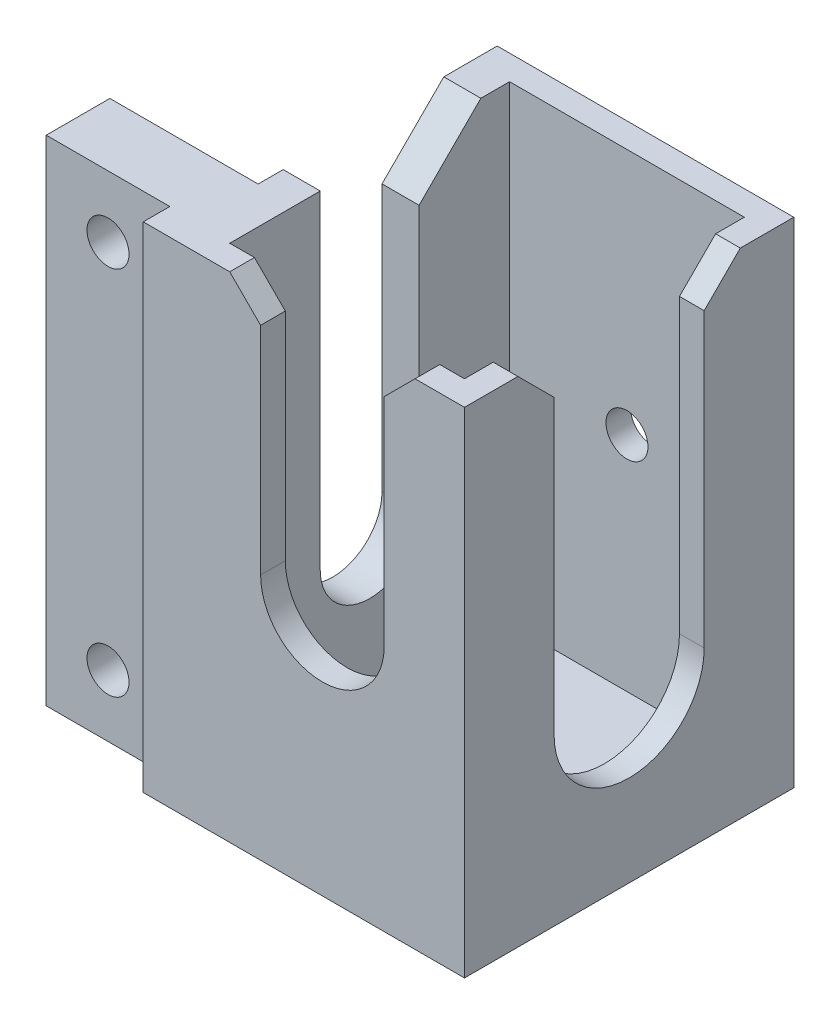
ISO-10303-21;
HEADER;
FILE_DESCRIPTION(('STEP AP214'),'2;1');
FILE_NAME('part.step','',(''),(''),'','','');
FILE_SCHEMA(('AUTOMOTIVE_DESIGN { 1 0 10303 214 1 1 1 1 }'));
ENDSEC;
DATA;
#1=APPLICATION_CONTEXT('core data for automotive mechanical design processes');
#2=APPLICATION_PROTOCOL_DEFINITION('international standard','automotive_design',2000,#1);
#3=PRODUCT_CONTEXT('',#1,'mechanical');
#4=PRODUCT('Part','Part','',(#3));
#5=PRODUCT_RELATED_PRODUCT_CATEGORY('part','',(#4));
#6=PRODUCT_DEFINITION_FORMATION('','',#4);
#7=PRODUCT_DEFINITION_CONTEXT('part definition',#1,'design');
#8=PRODUCT_DEFINITION('design','',#6,#7);
#9=PRODUCT_DEFINITION_SHAPE('','',#8);
#10=(LENGTH_UNIT() NAMED_UNIT(*) SI_UNIT(.MILLI.,.METRE.));
#11=(NAMED_UNIT(*) PLANE_ANGLE_UNIT() SI_UNIT($,.RADIAN.));
#12=(NAMED_UNIT(*) SI_UNIT($,.STERADIAN.) SOLID_ANGLE_UNIT());
#13=UNCERTAINTY_MEASURE_WITH_UNIT(LENGTH_MEASURE(1.E-05),#10,'distance_accuracy_value','');
#14=(GEOMETRIC_REPRESENTATION_CONTEXT(3) GLOBAL_UNCERTAINTY_ASSIGNED_CONTEXT((#13)) GLOBAL_UNIT_ASSIGNED_CONTEXT((#10,
#11,#12)) REPRESENTATION_CONTEXT('',''));
#15=CARTESIAN_POINT('',(0.,0.,0.));
#16=DIRECTION('',(0.,0.,1.));
#17=DIRECTION('',(1.,0.,0.));
#18=AXIS2_PLACEMENT_3D('',#15,#16,#17);
#19=CARTESIAN_POINT('',(-12.5000000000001,40.,6.02500000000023));
#20=DIRECTION('',(0.,0.,1.));
#21=DIRECTION('',(1.,0.,0.));
#22=AXIS2_PLACEMENT_3D('',#19,#20,#21);
#23=PLANE('',#22);
#24=CARTESIAN_POINT('',(-19.5000000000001,5.,6.02500000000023));
#25=DIRECTION('',(0.,0.,-1.));
#26=DIRECTION('',(-1.,0.,0.));
#27=AXIS2_PLACEMENT_3D('',#24,#25,#26);
#28=CIRCLE('',#27,3.5);
#29=CARTESIAN_POINT('',(-23.0000000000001,5.,6.02500000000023));
#30=VERTEX_POINT('',#29);
#31=EDGE_CURVE('E420',#30,#30,#28,.T.);
#32=ORIENTED_EDGE('',*,*,#31,.F.);
#33=EDGE_LOOP('',(#32));
#34=FACE_BOUND('',#33,.T.);
#35=DIRECTION('',(0.,-1.,0.));
#36=VECTOR('',#35,1.);
#37=CARTESIAN_POINT('',(-24.5000000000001,40.,6.02500000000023));
#38=LINE('',#37,#36);
#39=CARTESIAN_POINT('',(-24.5000000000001,10.,6.02500000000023));
#40=VERTEX_POINT('',#39);
#41=CARTESIAN_POINT('',(-24.5000000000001,0.,6.02500000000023));
#42=VERTEX_POINT('',#41);
#43=EDGE_CURVE('E384',#40,#42,#38,.T.);
#44=ORIENTED_EDGE('',*,*,#43,.F.);
#45=DIRECTION('',(-1.,0.,0.));
#46=VECTOR('',#45,1.);
#47=CARTESIAN_POINT('',(7.92602506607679,10.,6.02500000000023));
#48=LINE('',#47,#46);
#49=CARTESIAN_POINT('',(-12.5000000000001,10.,6.02500000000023));
#50=VERTEX_POINT('',#49);
#51=EDGE_CURVE('E470',#50,#40,#48,.T.);
#52=ORIENTED_EDGE('',*,*,#51,.F.);
#53=DIRECTION('',(0.,-1.,0.));
#54=VECTOR('',#53,1.);
#55=CARTESIAN_POINT('',(-12.5000000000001,40.,6.02500000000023));
#56=LINE('',#55,#54);
#57=CARTESIAN_POINT('',(-12.5000000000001,0.,6.02500000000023));
#58=VERTEX_POINT('',#57);
#59=EDGE_CURVE('E388',#50,#58,#56,.T.);
#60=ORIENTED_EDGE('',*,*,#59,.T.);
#61=DIRECTION('',(-1.,0.,0.));
#62=VECTOR('',#61,1.);
#63=CARTESIAN_POINT('',(-12.5000000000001,0.,6.02500000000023));
#64=LINE('',#63,#62);
#65=EDGE_CURVE('E373',#58,#42,#64,.T.);
#66=ORIENTED_EDGE('',*,*,#65,.T.);
#67=EDGE_LOOP('',(#44,#52,#60,#66));
#68=FACE_BOUND('',#67,.T.);
#69=ADVANCED_FACE('F41',(#34,#68),#23,.F.);
#70=CARTESIAN_POINT('',(0.,40.,0.));
#71=DIRECTION('',(0.,1.,0.));
#72=DIRECTION('',(0.,0.,1.));
#73=AXIS2_PLACEMENT_3D('',#70,#71,#72);
#74=PLANE('',#73);
#75=DIRECTION('',(1.,0.,0.));
#76=VECTOR('',#75,1.);
#77=CARTESIAN_POINT('',(-9.50000000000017,40.,11.3250000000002));
#78=LINE('',#77,#76);
#79=CARTESIAN_POINT('',(7.5,40.,11.3250000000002));
#80=VERTEX_POINT('',#79);
#81=CARTESIAN_POINT('',(9.50000000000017,40.,11.3250000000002));
#82=VERTEX_POINT('',#81);
#83=EDGE_CURVE('E318',#80,#82,#78,.T.);
#84=ORIENTED_EDGE('',*,*,#83,.F.);
#85=DIRECTION('',(0.,0.,1.));
#86=VECTOR('',#85,1.);
#87=CARTESIAN_POINT('',(7.5,40.,13.3250000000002));
#88=LINE('',#87,#86);
#89=CARTESIAN_POINT('',(7.5,40.,13.3250000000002));
#90=VERTEX_POINT('',#89);
#91=EDGE_CURVE('E11',#80,#90,#88,.T.);
#92=ORIENTED_EDGE('',*,*,#91,.T.);
#93=DIRECTION('',(1.,0.,0.));
#94=VECTOR('',#93,1.);
#95=CARTESIAN_POINT('',(-14.5000000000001,40.,13.3250000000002));
#96=LINE('',#95,#94);
#97=CARTESIAN_POINT('',(11.5000000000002,40.,13.3250000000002));
#98=VERTEX_POINT('',#97);
#99=EDGE_CURVE('E337',#90,#98,#96,.T.);
#100=ORIENTED_EDGE('',*,*,#99,.T.);
#101=DIRECTION('',(0.,0.,-1.));
#102=VECTOR('',#101,1.);
#103=CARTESIAN_POINT('',(11.5000000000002,40.,13.3250000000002));
#104=LINE('',#103,#102);
#105=CARTESIAN_POINT('',(11.5000000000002,40.,9.00000000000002));
#106=VERTEX_POINT('',#105);
#107=EDGE_CURVE('E343',#98,#106,#104,.T.);
#108=ORIENTED_EDGE('',*,*,#107,.T.);
#109=DIRECTION('',(1.,0.,0.));
#110=VECTOR('',#109,1.);
#111=CARTESIAN_POINT('',(2.42893218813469,40.,9.00000000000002));
#112=LINE('',#111,#110);
#113=CARTESIAN_POINT('',(9.50000000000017,40.,9.00000000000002));
#114=VERTEX_POINT('',#113);
#115=EDGE_CURVE('E562',#114,#106,#112,.T.);
#116=ORIENTED_EDGE('',*,*,#115,.F.);
#117=DIRECTION('',(0.,0.,-1.));
#118=VECTOR('',#117,1.);
#119=CARTESIAN_POINT('',(9.50000000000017,40.,11.3250000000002));
#120=LINE('',#119,#118);
#121=EDGE_CURVE('E304',#82,#114,#120,.T.);
#122=ORIENTED_EDGE('',*,*,#121,.F.);
#123=EDGE_LOOP('',(#84,#92,#100,#108,#116,#122));
#124=FACE_BOUND('',#123,.T.);
#125=ADVANCED_FACE('F554',(#124),#74,.T.);
#126=CARTESIAN_POINT('',(-14.5000000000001,40.,13.3250000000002));
#127=VERTEX_POINT('',#126);
#128=CARTESIAN_POINT('',(-7.5,40.,13.3250000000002));
#129=VERTEX_POINT('',#128);
#130=EDGE_CURVE('E339',#127,#129,#96,.T.);
#131=ORIENTED_EDGE('',*,*,#130,.T.);
#132=DIRECTION('',(0.,0.,-1.));
#133=VECTOR('',#132,1.);
#134=CARTESIAN_POINT('',(-7.5,40.,11.3250000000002));
#135=LINE('',#134,#133);
#136=CARTESIAN_POINT('',(-7.5,40.,11.3250000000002));
#137=VERTEX_POINT('',#136);
#138=EDGE_CURVE('E442',#129,#137,#135,.T.);
#139=ORIENTED_EDGE('',*,*,#138,.T.);
#140=CARTESIAN_POINT('',(-9.50000000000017,40.,11.3250000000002));
#141=VERTEX_POINT('',#140);
#142=EDGE_CURVE('E319',#141,#137,#78,.T.);
#143=ORIENTED_EDGE('',*,*,#142,.F.);
#144=DIRECTION('',(0.,0.,1.));
#145=VECTOR('',#144,1.);
#146=CARTESIAN_POINT('',(-9.50000000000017,40.,-11.3250000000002));
#147=LINE('',#146,#145);
#148=CARTESIAN_POINT('',(-9.50000000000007,40.,4.));
#149=VERTEX_POINT('',#148);
#150=EDGE_CURVE('E314',#149,#141,#147,.T.);
#151=ORIENTED_EDGE('',*,*,#150,.F.);
#152=DIRECTION('',(1.,0.,0.));
#153=VECTOR('',#152,1.);
#154=CARTESIAN_POINT('',(0.,40.,4.));
#155=LINE('',#154,#153);
#156=CARTESIAN_POINT('',(-12.5000000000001,40.,4.));
#157=VERTEX_POINT('',#156);
#158=EDGE_CURVE('E507',#157,#149,#155,.T.);
#159=ORIENTED_EDGE('',*,*,#158,.F.);
#160=DIRECTION('',(0.,0.,1.));
#161=VECTOR('',#160,1.);
#162=CARTESIAN_POINT('',(-12.5000000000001,40.,-13.3250000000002));
#163=LINE('',#162,#161);
#164=CARTESIAN_POINT('',(-12.5000000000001,40.,6.02500000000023));
#165=VERTEX_POINT('',#164);
#166=EDGE_CURVE('E348',#157,#165,#163,.T.);
#167=ORIENTED_EDGE('',*,*,#166,.T.);
#168=DIRECTION('',(-1.,0.,0.));
#169=VECTOR('',#168,1.);
#170=CARTESIAN_POINT('',(-12.5000000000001,40.,6.02500000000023));
#171=LINE('',#170,#169);
#172=CARTESIAN_POINT('',(-24.5000000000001,40.,6.02500000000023));
#173=VERTEX_POINT('',#172);
#174=EDGE_CURVE('E352',#165,#173,#171,.T.);
#175=ORIENTED_EDGE('',*,*,#174,.T.);
#176=DIRECTION('',(0.,0.,1.));
#177=VECTOR('',#176,1.);
#178=CARTESIAN_POINT('',(-24.5000000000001,40.,6.02500000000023));
#179=LINE('',#178,#177);
#180=CARTESIAN_POINT('',(-24.5000000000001,40.,11.1750000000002));
#181=VERTEX_POINT('',#180);
#182=EDGE_CURVE('E354',#173,#181,#179,.T.);
#183=ORIENTED_EDGE('',*,*,#182,.T.);
#184=DIRECTION('',(1.,0.,0.));
#185=VECTOR('',#184,1.);
#186=CARTESIAN_POINT('',(-24.5000000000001,40.,11.1750000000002));
#187=LINE('',#186,#185);
#188=CARTESIAN_POINT('',(-14.5000000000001,40.,11.1750000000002));
#189=VERTEX_POINT('',#188);
#190=EDGE_CURVE('E356',#181,#189,#187,.T.);
#191=ORIENTED_EDGE('',*,*,#190,.T.);
#192=DIRECTION('',(0.,0.,1.));
#193=VECTOR('',#192,1.);
#194=CARTESIAN_POINT('',(-14.5000000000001,40.,11.1750000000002));
#195=LINE('',#194,#193);
#196=EDGE_CURVE('E334',#189,#127,#195,.T.);
#197=ORIENTED_EDGE('',*,*,#196,.T.);
#198=EDGE_LOOP('',(#131,#139,#143,#151,#159,#167,#175,#183,#191,#197));
#199=FACE_BOUND('',#198,.T.);
#200=ADVANCED_FACE('F630',(#199),#74,.T.);
#201=CARTESIAN_POINT('',(9.50000000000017,40.,11.3250000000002));
#202=DIRECTION('',(-1.,0.,0.));
#203=DIRECTION('',(0.,0.,1.));
#204=AXIS2_PLACEMENT_3D('',#201,#202,#203);
#205=PLANE('',#204);
#206=DIRECTION('',(0.,0.707106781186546,-0.707106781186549));
#207=VECTOR('',#206,1.);
#208=CARTESIAN_POINT('',(9.50000000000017,35.,-4.));
#209=LINE('',#208,#207);
#210=CARTESIAN_POINT('',(9.50000000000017,37.075,-6.075));
#211=VERTEX_POINT('',#210);
#212=CARTESIAN_POINT('',(9.50000000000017,40.,-9.00000000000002));
#213=VERTEX_POINT('',#212);
#214=EDGE_CURVE('E282',#211,#213,#209,.T.);
#215=ORIENTED_EDGE('',*,*,#214,.T.);
#216=CARTESIAN_POINT('',(9.50000000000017,40.,-11.3250000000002));
#217=VERTEX_POINT('',#216);
#218=EDGE_CURVE('E295',#213,#217,#120,.T.);
#219=ORIENTED_EDGE('',*,*,#218,.T.);
#220=DIRECTION('',(0.,-1.,0.));
#221=VECTOR('',#220,1.);
#222=CARTESIAN_POINT('',(9.50000000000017,40.,-11.3250000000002));
#223=LINE('',#222,#221);
#224=CARTESIAN_POINT('',(9.50000000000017,2.,-11.3250000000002));
#225=VERTEX_POINT('',#224);
#226=EDGE_CURVE('E331',#217,#225,#223,.T.);
#227=ORIENTED_EDGE('',*,*,#226,.T.);
#228=DIRECTION('',(0.,0.,1.));
#229=VECTOR('',#228,1.);
#230=CARTESIAN_POINT('',(9.50000000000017,2.,11.3250000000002));
#231=LINE('',#230,#229);
#232=CARTESIAN_POINT('',(9.50000000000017,2.,11.3250000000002));
#233=VERTEX_POINT('',#232);
#234=EDGE_CURVE('E305',#225,#233,#231,.T.);
#235=ORIENTED_EDGE('',*,*,#234,.T.);
#236=DIRECTION('',(0.,-1.,0.));
#237=VECTOR('',#236,1.);
#238=CARTESIAN_POINT('',(9.50000000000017,40.,11.3250000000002));
#239=LINE('',#238,#237);
#240=EDGE_CURVE('E322',#82,#233,#239,.T.);
#241=ORIENTED_EDGE('',*,*,#240,.F.);
#242=ORIENTED_EDGE('',*,*,#121,.T.);
#243=DIRECTION('',(0.,-0.707106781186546,-0.707106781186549));
#244=VECTOR('',#243,1.);
#245=CARTESIAN_POINT('',(9.50000000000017,35.,4.));
#246=LINE('',#245,#244);
#247=CARTESIAN_POINT('',(9.50000000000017,37.075,6.075));
#248=VERTEX_POINT('',#247);
#249=EDGE_CURVE('E569',#114,#248,#246,.T.);
#250=ORIENTED_EDGE('',*,*,#249,.T.);
#251=DIRECTION('',(0.,1.,0.));
#252=VECTOR('',#251,1.);
#253=CARTESIAN_POINT('',(9.50000000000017,43.3626682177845,6.075));
#254=LINE('',#253,#252);
#255=CARTESIAN_POINT('',(9.50000000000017,13.43,6.075));
#256=VERTEX_POINT('',#255);
#257=EDGE_CURVE('E477',#256,#248,#254,.T.);
#258=ORIENTED_EDGE('',*,*,#257,.F.);
#259=CARTESIAN_POINT('',(9.50000000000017,13.43,0.));
#260=DIRECTION('',(-1.,0.,0.));
#261=DIRECTION('',(0.,0.,1.));
#262=AXIS2_PLACEMENT_3D('',#259,#260,#261);
#263=CIRCLE('',#262,6.075);
#264=CARTESIAN_POINT('',(9.50000000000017,13.43,-6.075));
#265=VERTEX_POINT('',#264);
#266=EDGE_CURVE('E482',#265,#256,#263,.T.);
#267=ORIENTED_EDGE('',*,*,#266,.F.);
#268=DIRECTION('',(0.,-1.,0.));
#269=VECTOR('',#268,1.);
#270=CARTESIAN_POINT('',(9.50000000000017,43.3626682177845,-6.075));
#271=LINE('',#270,#269);
#272=EDGE_CURVE('E298',#211,#265,#271,.T.);
#273=ORIENTED_EDGE('',*,*,#272,.F.);
#274=EDGE_LOOP('',(#215,#219,#227,#235,#241,#242,#250,#258,#267,#273));
#275=FACE_BOUND('',#274,.T.);
#276=ADVANCED_FACE('F293',(#275),#205,.T.);
#277=CARTESIAN_POINT('',(9.50000000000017,40.,-11.3250000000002));
#278=DIRECTION('',(0.,0.,1.));
#279=DIRECTION('',(1.,0.,0.));
#280=AXIS2_PLACEMENT_3D('',#277,#278,#279);
#281=PLANE('',#280);
#282=CARTESIAN_POINT('',(0.,20.,-11.3250000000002));
#283=DIRECTION('',(0.,0.,1.));
#284=DIRECTION('',(1.,0.,0.));
#285=AXIS2_PLACEMENT_3D('',#282,#283,#284);
#286=CIRCLE('',#285,1.7);
#287=CARTESIAN_POINT('',(1.7,20.,-11.3250000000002));
#288=VERTEX_POINT('',#287);
#289=EDGE_CURVE('E578',#288,#288,#286,.F.);
#290=ORIENTED_EDGE('',*,*,#289,.T.);
#291=EDGE_LOOP('',(#290));
#292=FACE_BOUND('',#291,.T.);
#293=DIRECTION('',(0.,-1.,0.));
#294=VECTOR('',#293,1.);
#295=CARTESIAN_POINT('',(-9.50000000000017,40.,-11.3250000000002));
#296=LINE('',#295,#294);
#297=CARTESIAN_POINT('',(-9.50000000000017,40.,-11.3250000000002));
#298=VERTEX_POINT('',#297);
#299=CARTESIAN_POINT('',(-9.50000000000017,2.,-11.3250000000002));
#300=VERTEX_POINT('',#299);
#301=EDGE_CURVE('E328',#298,#300,#296,.T.);
#302=ORIENTED_EDGE('',*,*,#301,.T.);
#303=DIRECTION('',(1.,0.,0.));
#304=VECTOR('',#303,1.);
#305=CARTESIAN_POINT('',(9.50000000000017,2.,-11.3250000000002));
#306=LINE('',#305,#304);
#307=EDGE_CURVE('E309',#300,#225,#306,.T.);
#308=ORIENTED_EDGE('',*,*,#307,.T.);
#309=ORIENTED_EDGE('',*,*,#226,.F.);
#310=DIRECTION('',(-1.,0.,0.));
#311=VECTOR('',#310,1.);
#312=CARTESIAN_POINT('',(9.50000000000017,40.,-11.3250000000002));
#313=LINE('',#312,#311);
#314=EDGE_CURVE('E303',#217,#298,#313,.T.);
#315=ORIENTED_EDGE('',*,*,#314,.T.);
#316=EDGE_LOOP('',(#302,#308,#309,#315));
#317=FACE_BOUND('',#316,.T.);
#318=ADVANCED_FACE('F547',(#292,#317),#281,.T.);
#319=CARTESIAN_POINT('',(-9.50000000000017,40.,-11.3250000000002));
#320=DIRECTION('',(1.,0.,0.));
#321=DIRECTION('',(0.,0.,-1.));
#322=AXIS2_PLACEMENT_3D('',#319,#320,#321);
#323=PLANE('',#322);
#324=CARTESIAN_POINT('',(-9.50000000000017,40.,-9.00000000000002));
#325=VERTEX_POINT('',#324);
#326=EDGE_CURVE('E315',#298,#325,#147,.T.);
#327=ORIENTED_EDGE('',*,*,#326,.T.);
#328=DIRECTION('',(0.,-0.707106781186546,0.707106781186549));
#329=VECTOR('',#328,1.);
#330=CARTESIAN_POINT('',(-9.50000000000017,41.1625000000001,-10.1625000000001));
#331=LINE('',#330,#329);
#332=CARTESIAN_POINT('',(-9.50000000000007,35.,-4.));
#333=VERTEX_POINT('',#332);
#334=EDGE_CURVE('E428',#325,#333,#331,.T.);
#335=ORIENTED_EDGE('',*,*,#334,.T.);
#336=DIRECTION('',(0.,-1.,0.));
#337=VECTOR('',#336,1.);
#338=CARTESIAN_POINT('',(-9.50000000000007,46.4459505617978,-4.));
#339=LINE('',#338,#337);
#340=CARTESIAN_POINT('',(-9.50000000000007,13.43,-3.99999999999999));
#341=VERTEX_POINT('',#340);
#342=EDGE_CURVE('E492',#333,#341,#339,.T.);
#343=ORIENTED_EDGE('',*,*,#342,.T.);
#344=CARTESIAN_POINT('',(-9.50000000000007,13.43,0.));
#345=DIRECTION('',(-1.,0.,0.));
#346=DIRECTION('',(0.,0.,1.));
#347=AXIS2_PLACEMENT_3D('',#344,#345,#346);
#348=CIRCLE('',#347,4.);
#349=CARTESIAN_POINT('',(-9.50000000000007,13.43,4.));
#350=VERTEX_POINT('',#349);
#351=EDGE_CURVE('E494',#341,#350,#348,.T.);
#352=ORIENTED_EDGE('',*,*,#351,.T.);
#353=DIRECTION('',(0.,1.,0.));
#354=VECTOR('',#353,1.);
#355=CARTESIAN_POINT('',(-9.50000000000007,46.4459505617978,4.));
#356=LINE('',#355,#354);
#357=EDGE_CURVE('E498',#350,#149,#356,.T.);
#358=ORIENTED_EDGE('',*,*,#357,.T.);
#359=ORIENTED_EDGE('',*,*,#150,.T.);
#360=DIRECTION('',(0.,-1.,0.));
#361=VECTOR('',#360,1.);
#362=CARTESIAN_POINT('',(-9.50000000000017,40.,11.3250000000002));
#363=LINE('',#362,#361);
#364=CARTESIAN_POINT('',(-9.50000000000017,2.,11.3250000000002));
#365=VERTEX_POINT('',#364);
#366=EDGE_CURVE('E325',#141,#365,#363,.T.);
#367=ORIENTED_EDGE('',*,*,#366,.T.);
#368=DIRECTION('',(0.,0.,-1.));
#369=VECTOR('',#368,1.);
#370=CARTESIAN_POINT('',(-9.50000000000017,2.,-11.3250000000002));
#371=LINE('',#370,#369);
#372=EDGE_CURVE('E537',#365,#300,#371,.T.);
#373=ORIENTED_EDGE('',*,*,#372,.T.);
#374=ORIENTED_EDGE('',*,*,#301,.F.);
#375=EDGE_LOOP('',(#327,#335,#343,#352,#358,#359,#367,#373,#374));
#376=FACE_BOUND('',#375,.T.);
#377=ADVANCED_FACE('F698',(#376),#323,.T.);
#378=CARTESIAN_POINT('',(-9.50000000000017,40.,11.3250000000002));
#379=DIRECTION('',(0.,0.,-1.));
#380=DIRECTION('',(-1.,0.,0.));
#381=AXIS2_PLACEMENT_3D('',#378,#379,#380);
#382=PLANE('',#381);
#383=ORIENTED_EDGE('',*,*,#142,.T.);
#384=DIRECTION('',(0.707106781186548,-0.707106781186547,0.));
#385=VECTOR('',#384,1.);
#386=CARTESIAN_POINT('',(-8.50000000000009,41.0000000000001,11.3250000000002));
#387=LINE('',#386,#385);
#388=CARTESIAN_POINT('',(-5.,37.5,11.3250000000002));
#389=VERTEX_POINT('',#388);
#390=EDGE_CURVE('E445',#137,#389,#387,.T.);
#391=ORIENTED_EDGE('',*,*,#390,.T.);
#392=DIRECTION('',(0.,-1.,0.));
#393=VECTOR('',#392,1.);
#394=CARTESIAN_POINT('',(-5.,47.9306355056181,11.3250000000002));
#395=LINE('',#394,#393);
#396=CARTESIAN_POINT('',(-5.,20.,11.3250000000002));
#397=VERTEX_POINT('',#396);
#398=EDGE_CURVE('E463',#389,#397,#395,.T.);
#399=ORIENTED_EDGE('',*,*,#398,.T.);
#400=CARTESIAN_POINT('',(0.,20.,11.3250000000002));
#401=DIRECTION('',(0.,0.,1.));
#402=DIRECTION('',(1.,0.,0.));
#403=AXIS2_PLACEMENT_3D('',#400,#401,#402);
#404=CIRCLE('',#403,5.);
#405=CARTESIAN_POINT('',(5.,20.,11.3250000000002));
#406=VERTEX_POINT('',#405);
#407=EDGE_CURVE('E457',#397,#406,#404,.T.);
#408=ORIENTED_EDGE('',*,*,#407,.T.);
#409=DIRECTION('',(0.,1.,0.));
#410=VECTOR('',#409,1.);
#411=CARTESIAN_POINT('',(5.,47.9306355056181,11.3250000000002));
#412=LINE('',#411,#410);
#413=CARTESIAN_POINT('',(5.,37.5,11.3250000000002));
#414=VERTEX_POINT('',#413);
#415=EDGE_CURVE('E450',#406,#414,#412,.T.);
#416=ORIENTED_EDGE('',*,*,#415,.T.);
#417=DIRECTION('',(0.707106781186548,0.707106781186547,0.));
#418=VECTOR('',#417,1.);
#419=CARTESIAN_POINT('',(-1.00000000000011,31.4999999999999,11.3250000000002));
#420=LINE('',#419,#418);
#421=EDGE_CURVE('E57',#414,#80,#420,.T.);
#422=ORIENTED_EDGE('',*,*,#421,.T.);
#423=ORIENTED_EDGE('',*,*,#83,.T.);
#424=ORIENTED_EDGE('',*,*,#240,.T.);
#425=DIRECTION('',(-1.,0.,0.));
#426=VECTOR('',#425,1.);
#427=CARTESIAN_POINT('',(-9.50000000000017,2.,11.3250000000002));
#428=LINE('',#427,#426);
#429=EDGE_CURVE('E400',#233,#365,#428,.T.);
#430=ORIENTED_EDGE('',*,*,#429,.T.);
#431=ORIENTED_EDGE('',*,*,#366,.F.);
#432=EDGE_LOOP('',(#383,#391,#399,#408,#416,#422,#423,#424,#430,#431));
#433=FACE_BOUND('',#432,.T.);
#434=ADVANCED_FACE('F455',(#433),#382,.T.);
#435=DIRECTION('',(1.,0.,0.));
#436=VECTOR('',#435,1.);
#437=CARTESIAN_POINT('',(2.42893218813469,40.,-9.00000000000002));
#438=LINE('',#437,#436);
#439=CARTESIAN_POINT('',(11.5000000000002,40.,-9.00000000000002));
#440=VERTEX_POINT('',#439);
#441=EDGE_CURVE('E279',#213,#440,#438,.T.);
#442=ORIENTED_EDGE('',*,*,#441,.T.);
#443=CARTESIAN_POINT('',(11.5000000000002,40.,-13.3250000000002));
#444=VERTEX_POINT('',#443);
#445=EDGE_CURVE('E342',#440,#444,#104,.T.);
#446=ORIENTED_EDGE('',*,*,#445,.T.);
#447=DIRECTION('',(-1.,0.,0.));
#448=VECTOR('',#447,1.);
#449=CARTESIAN_POINT('',(11.5000000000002,40.,-13.3250000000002));
#450=LINE('',#449,#448);
#451=CARTESIAN_POINT('',(-12.5000000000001,40.,-13.3250000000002));
#452=VERTEX_POINT('',#451);
#453=EDGE_CURVE('E346',#444,#452,#450,.T.);
#454=ORIENTED_EDGE('',*,*,#453,.T.);
#455=CARTESIAN_POINT('',(-12.5000000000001,40.,-9.00000000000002));
#456=VERTEX_POINT('',#455);
#457=EDGE_CURVE('E349',#452,#456,#163,.T.);
#458=ORIENTED_EDGE('',*,*,#457,.T.);
#459=DIRECTION('',(1.,0.,0.));
#460=VECTOR('',#459,1.);
#461=CARTESIAN_POINT('',(-9.50000000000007,40.,-9.00000000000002));
#462=LINE('',#461,#460);
#463=EDGE_CURVE('E426',#456,#325,#462,.T.);
#464=ORIENTED_EDGE('',*,*,#463,.T.);
#465=ORIENTED_EDGE('',*,*,#326,.F.);
#466=ORIENTED_EDGE('',*,*,#314,.F.);
#467=ORIENTED_EDGE('',*,*,#218,.F.);
#468=EDGE_LOOP('',(#442,#446,#454,#458,#464,#465,#466,#467));
#469=FACE_BOUND('',#468,.T.);
#470=ADVANCED_FACE('F301',(#469),#74,.T.);
#471=CARTESIAN_POINT('',(0.,0.,0.));
#472=DIRECTION('',(0.,1.,0.));
#473=DIRECTION('',(0.,0.,1.));
#474=AXIS2_PLACEMENT_3D('',#471,#472,#473);
#475=PLANE('',#474);
#476=DIRECTION('',(0.,0.,1.));
#477=VECTOR('',#476,1.);
#478=CARTESIAN_POINT('',(-14.5000000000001,0.,11.1750000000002));
#479=LINE('',#478,#477);
#480=CARTESIAN_POINT('',(-14.5000000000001,0.,11.1750000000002));
#481=VERTEX_POINT('',#480);
#482=CARTESIAN_POINT('',(-14.5000000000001,0.,13.3250000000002));
#483=VERTEX_POINT('',#482);
#484=EDGE_CURVE('E333',#481,#483,#479,.T.);
#485=ORIENTED_EDGE('',*,*,#484,.F.);
#486=DIRECTION('',(1.,0.,0.));
#487=VECTOR('',#486,1.);
#488=CARTESIAN_POINT('',(-24.5000000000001,0.,11.1750000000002));
#489=LINE('',#488,#487);
#490=CARTESIAN_POINT('',(-24.5000000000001,0.,11.1750000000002));
#491=VERTEX_POINT('',#490);
#492=EDGE_CURVE('E338',#491,#481,#489,.T.);
#493=ORIENTED_EDGE('',*,*,#492,.F.);
#494=DIRECTION('',(0.,0.,1.));
#495=VECTOR('',#494,1.);
#496=CARTESIAN_POINT('',(-24.5000000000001,0.,6.02500000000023));
#497=LINE('',#496,#495);
#498=EDGE_CURVE('E376',#42,#491,#497,.T.);
#499=ORIENTED_EDGE('',*,*,#498,.F.);
#500=ORIENTED_EDGE('',*,*,#65,.F.);
#501=DIRECTION('',(0.,0.,1.));
#502=VECTOR('',#501,1.);
#503=CARTESIAN_POINT('',(-12.5000000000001,0.,-13.3250000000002));
#504=LINE('',#503,#502);
#505=CARTESIAN_POINT('',(-12.5000000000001,0.,-13.3250000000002));
#506=VERTEX_POINT('',#505);
#507=EDGE_CURVE('E370',#506,#58,#504,.T.);
#508=ORIENTED_EDGE('',*,*,#507,.F.);
#509=DIRECTION('',(-1.,0.,0.));
#510=VECTOR('',#509,1.);
#511=CARTESIAN_POINT('',(11.5000000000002,0.,-13.3250000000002));
#512=LINE('',#511,#510);
#513=CARTESIAN_POINT('',(11.5000000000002,0.,-13.3250000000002));
#514=VERTEX_POINT('',#513);
#515=EDGE_CURVE('E367',#514,#506,#512,.T.);
#516=ORIENTED_EDGE('',*,*,#515,.F.);
#517=DIRECTION('',(0.,0.,-1.));
#518=VECTOR('',#517,1.);
#519=CARTESIAN_POINT('',(11.5000000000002,0.,13.3250000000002));
#520=LINE('',#519,#518);
#521=CARTESIAN_POINT('',(11.5000000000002,0.,13.3250000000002));
#522=VERTEX_POINT('',#521);
#523=EDGE_CURVE('E364',#522,#514,#520,.T.);
#524=ORIENTED_EDGE('',*,*,#523,.F.);
#525=DIRECTION('',(1.,0.,0.));
#526=VECTOR('',#525,1.);
#527=CARTESIAN_POINT('',(-14.5000000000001,0.,13.3250000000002));
#528=LINE('',#527,#526);
#529=EDGE_CURVE('E361',#483,#522,#528,.T.);
#530=ORIENTED_EDGE('',*,*,#529,.F.);
#531=EDGE_LOOP('',(#485,#493,#499,#500,#508,#516,#524,#530));
#532=FACE_BOUND('',#531,.T.);
#533=DIRECTION('',(-1.,0.,0.));
#534=VECTOR('',#533,1.);
#535=CARTESIAN_POINT('',(1.7299999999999,0.,2.74999999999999));
#536=LINE('',#535,#534);
#537=CARTESIAN_POINT('',(1.7299999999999,0.,2.74999999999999));
#538=VERTEX_POINT('',#537);
#539=CARTESIAN_POINT('',(-1.7299999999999,0.,2.75000000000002));
#540=VERTEX_POINT('',#539);
#541=EDGE_CURVE('E511',#538,#540,#536,.T.);
#542=ORIENTED_EDGE('',*,*,#541,.F.);
#543=DIRECTION('',(0.,0.,1.));
#544=VECTOR('',#543,1.);
#545=CARTESIAN_POINT('',(1.7299999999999,0.,-2.75000000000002));
#546=LINE('',#545,#544);
#547=CARTESIAN_POINT('',(1.7299999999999,0.,-2.75000000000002));
#548=VERTEX_POINT('',#547);
#549=EDGE_CURVE('E516',#548,#538,#546,.T.);
#550=ORIENTED_EDGE('',*,*,#549,.F.);
#551=DIRECTION('',(1.,0.,0.));
#552=VECTOR('',#551,1.);
#553=CARTESIAN_POINT('',(-1.7299999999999,0.,-2.74999999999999));
#554=LINE('',#553,#552);
#555=CARTESIAN_POINT('',(-1.7299999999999,0.,-2.74999999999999));
#556=VERTEX_POINT('',#555);
#557=EDGE_CURVE('E530',#556,#548,#554,.T.);
#558=ORIENTED_EDGE('',*,*,#557,.F.);
#559=DIRECTION('',(0.,0.,-1.));
#560=VECTOR('',#559,1.);
#561=CARTESIAN_POINT('',(-1.7299999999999,0.,2.75000000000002));
#562=LINE('',#561,#560);
#563=EDGE_CURVE('E527',#540,#556,#562,.T.);
#564=ORIENTED_EDGE('',*,*,#563,.F.);
#565=EDGE_LOOP('',(#542,#550,#558,#564));
#566=FACE_BOUND('',#565,.T.);
#567=ADVANCED_FACE('F734',(#532,#566),#475,.F.);
#568=CARTESIAN_POINT('',(-14.5000000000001,40.,11.1750000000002));
#569=DIRECTION('',(1.,0.,0.));
#570=DIRECTION('',(0.,0.,-1.));
#571=AXIS2_PLACEMENT_3D('',#568,#569,#570);
#572=PLANE('',#571);
#573=ORIENTED_EDGE('',*,*,#484,.T.);
#574=DIRECTION('',(0.,-1.,0.));
#575=VECTOR('',#574,1.);
#576=CARTESIAN_POINT('',(-14.5000000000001,40.,13.3250000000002));
#577=LINE('',#576,#575);
#578=EDGE_CURVE('E398',#127,#483,#577,.T.);
#579=ORIENTED_EDGE('',*,*,#578,.F.);
#580=ORIENTED_EDGE('',*,*,#196,.F.);
#581=DIRECTION('',(0.,-1.,0.));
#582=VECTOR('',#581,1.);
#583=CARTESIAN_POINT('',(-14.5000000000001,40.,11.1750000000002));
#584=LINE('',#583,#582);
#585=EDGE_CURVE('E358',#189,#481,#584,.T.);
#586=ORIENTED_EDGE('',*,*,#585,.T.);
#587=EDGE_LOOP('',(#573,#579,#580,#586));
#588=FACE_BOUND('',#587,.T.);
#589=ADVANCED_FACE('F736',(#588),#572,.F.);
#590=CARTESIAN_POINT('',(-14.5000000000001,40.,13.3250000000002));
#591=DIRECTION('',(0.,0.,-1.));
#592=DIRECTION('',(-1.,0.,0.));
#593=AXIS2_PLACEMENT_3D('',#590,#591,#592);
#594=PLANE('',#593);
#595=DIRECTION('',(0.,1.,0.));
#596=VECTOR('',#595,1.);
#597=CARTESIAN_POINT('',(-5.,40.,13.3250000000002));
#598=LINE('',#597,#596);
#599=CARTESIAN_POINT('',(-5.,20.,13.3250000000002));
#600=VERTEX_POINT('',#599);
#601=CARTESIAN_POINT('',(-5.,37.5,13.3250000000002));
#602=VERTEX_POINT('',#601);
#603=EDGE_CURVE('E408',#600,#602,#598,.T.);
#604=ORIENTED_EDGE('',*,*,#603,.T.);
#605=DIRECTION('',(-0.707106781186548,0.707106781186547,0.));
#606=VECTOR('',#605,1.);
#607=CARTESIAN_POINT('',(-5.,37.5,13.3250000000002));
#608=LINE('',#607,#606);
#609=EDGE_CURVE('E440',#602,#129,#608,.T.);
#610=ORIENTED_EDGE('',*,*,#609,.T.);
#611=ORIENTED_EDGE('',*,*,#130,.F.);
#612=ORIENTED_EDGE('',*,*,#578,.T.);
#613=ORIENTED_EDGE('',*,*,#529,.T.);
#614=DIRECTION('',(0.,-1.,0.));
#615=VECTOR('',#614,1.);
#616=CARTESIAN_POINT('',(11.5000000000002,40.,13.3250000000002));
#617=LINE('',#616,#615);
#618=EDGE_CURVE('E396',#98,#522,#617,.T.);
#619=ORIENTED_EDGE('',*,*,#618,.F.);
#620=ORIENTED_EDGE('',*,*,#99,.F.);
#621=DIRECTION('',(-0.707106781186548,-0.707106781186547,0.));
#622=VECTOR('',#621,1.);
#623=CARTESIAN_POINT('',(5.,37.5,13.3250000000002));
#624=LINE('',#623,#622);
#625=CARTESIAN_POINT('',(5.,37.5,13.3250000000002));
#626=VERTEX_POINT('',#625);
#627=EDGE_CURVE('E438',#90,#626,#624,.T.);
#628=ORIENTED_EDGE('',*,*,#627,.T.);
#629=DIRECTION('',(0.,1.,0.));
#630=VECTOR('',#629,1.);
#631=CARTESIAN_POINT('',(5.,47.9306355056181,13.3250000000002));
#632=LINE('',#631,#630);
#633=CARTESIAN_POINT('',(5.,20.,13.3250000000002));
#634=VERTEX_POINT('',#633);
#635=EDGE_CURVE('E453',#634,#626,#632,.T.);
#636=ORIENTED_EDGE('',*,*,#635,.F.);
#637=CARTESIAN_POINT('',(0.,20.,13.3250000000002));
#638=DIRECTION('',(0.,0.,1.));
#639=DIRECTION('',(1.,0.,0.));
#640=AXIS2_PLACEMENT_3D('',#637,#638,#639);
#641=CIRCLE('',#640,5.);
#642=EDGE_CURVE('E467',#600,#634,#641,.T.);
#643=ORIENTED_EDGE('',*,*,#642,.F.);
#644=EDGE_LOOP('',(#604,#610,#611,#612,#613,#619,#620,#628,#636,#643));
#645=FACE_BOUND('',#644,.T.);
#646=ADVANCED_FACE('F558',(#645),#594,.F.);
#647=CARTESIAN_POINT('',(11.5000000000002,40.,13.3250000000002));
#648=DIRECTION('',(-1.,0.,0.));
#649=DIRECTION('',(0.,0.,1.));
#650=AXIS2_PLACEMENT_3D('',#647,#648,#649);
#651=PLANE('',#650);
#652=ORIENTED_EDGE('',*,*,#445,.F.);
#653=DIRECTION('',(0.,0.707106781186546,-0.707106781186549));
#654=VECTOR('',#653,1.);
#655=CARTESIAN_POINT('',(11.5000000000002,35.,-4.));
#656=LINE('',#655,#654);
#657=CARTESIAN_POINT('',(11.5000000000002,37.075,-6.075));
#658=VERTEX_POINT('',#657);
#659=EDGE_CURVE('E285',#658,#440,#656,.T.);
#660=ORIENTED_EDGE('',*,*,#659,.F.);
#661=DIRECTION('',(0.,-1.,0.));
#662=VECTOR('',#661,1.);
#663=CARTESIAN_POINT('',(11.5000000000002,40.,-6.075));
#664=LINE('',#663,#662);
#665=CARTESIAN_POINT('',(11.5000000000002,13.43,-6.075));
#666=VERTEX_POINT('',#665);
#667=EDGE_CURVE('E406',#658,#666,#664,.T.);
#668=ORIENTED_EDGE('',*,*,#667,.T.);
#669=CARTESIAN_POINT('',(11.5000000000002,13.43,0.));
#670=DIRECTION('',(-1.,0.,0.));
#671=DIRECTION('',(0.,0.,1.));
#672=AXIS2_PLACEMENT_3D('',#669,#670,#671);
#673=CIRCLE('',#672,6.075);
#674=CARTESIAN_POINT('',(11.5000000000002,13.43,6.075));
#675=VERTEX_POINT('',#674);
#676=EDGE_CURVE('E473',#666,#675,#673,.T.);
#677=ORIENTED_EDGE('',*,*,#676,.T.);
#678=DIRECTION('',(0.,1.,0.));
#679=VECTOR('',#678,1.);
#680=CARTESIAN_POINT('',(11.5000000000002,43.3626682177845,6.075));
#681=LINE('',#680,#679);
#682=CARTESIAN_POINT('',(11.5000000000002,37.075,6.075));
#683=VERTEX_POINT('',#682);
#684=EDGE_CURVE('E476',#675,#683,#681,.T.);
#685=ORIENTED_EDGE('',*,*,#684,.T.);
#686=DIRECTION('',(0.,-0.707106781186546,-0.707106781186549));
#687=VECTOR('',#686,1.);
#688=CARTESIAN_POINT('',(11.5000000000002,35.,4.));
#689=LINE('',#688,#687);
#690=EDGE_CURVE('E566',#106,#683,#689,.T.);
#691=ORIENTED_EDGE('',*,*,#690,.F.);
#692=ORIENTED_EDGE('',*,*,#107,.F.);
#693=ORIENTED_EDGE('',*,*,#618,.T.);
#694=ORIENTED_EDGE('',*,*,#523,.T.);
#695=DIRECTION('',(0.,-1.,0.));
#696=VECTOR('',#695,1.);
#697=CARTESIAN_POINT('',(11.5000000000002,40.,-13.3250000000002));
#698=LINE('',#697,#696);
#699=EDGE_CURVE('E394',#444,#514,#698,.T.);
#700=ORIENTED_EDGE('',*,*,#699,.F.);
#701=EDGE_LOOP('',(#652,#660,#668,#677,#685,#691,#692,#693,#694,#700));
#702=FACE_BOUND('',#701,.T.);
#703=ADVANCED_FACE('F565',(#702),#651,.F.);
#704=CARTESIAN_POINT('',(11.5000000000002,40.,-13.3250000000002));
#705=DIRECTION('',(0.,0.,1.));
#706=DIRECTION('',(1.,0.,0.));
#707=AXIS2_PLACEMENT_3D('',#704,#705,#706);
#708=PLANE('',#707);
#709=CARTESIAN_POINT('',(0.,20.,-13.3250000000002));
#710=DIRECTION('',(0.,0.,-1.));
#711=DIRECTION('',(-1.,0.,0.));
#712=AXIS2_PLACEMENT_3D('',#709,#710,#711);
#713=CIRCLE('',#712,1.7);
#714=CARTESIAN_POINT('',(-1.69999999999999,20.,-13.3250000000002));
#715=VERTEX_POINT('',#714);
#716=EDGE_CURVE('E289',#715,#715,#713,.T.);
#717=ORIENTED_EDGE('',*,*,#716,.F.);
#718=EDGE_LOOP('',(#717));
#719=FACE_BOUND('',#718,.T.);
#720=ORIENTED_EDGE('',*,*,#515,.T.);
#721=DIRECTION('',(0.,-1.,0.));
#722=VECTOR('',#721,1.);
#723=CARTESIAN_POINT('',(-12.5000000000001,40.,-13.3250000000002));
#724=LINE('',#723,#722);
#725=EDGE_CURVE('E392',#452,#506,#724,.T.);
#726=ORIENTED_EDGE('',*,*,#725,.F.);
#727=ORIENTED_EDGE('',*,*,#453,.F.);
#728=ORIENTED_EDGE('',*,*,#699,.T.);
#729=EDGE_LOOP('',(#720,#726,#727,#728));
#730=FACE_BOUND('',#729,.T.);
#731=ADVANCED_FACE('F669',(#719,#730),#708,.F.);
#732=CARTESIAN_POINT('',(-12.5000000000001,40.,-13.3250000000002));
#733=DIRECTION('',(1.,0.,0.));
#734=DIRECTION('',(0.,0.,-1.));
#735=AXIS2_PLACEMENT_3D('',#732,#733,#734);
#736=PLANE('',#735);
#737=DIRECTION('',(0.,1.,0.));
#738=VECTOR('',#737,1.);
#739=CARTESIAN_POINT('',(-12.5000000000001,40.,-4.));
#740=LINE('',#739,#738);
#741=CARTESIAN_POINT('',(-12.5000000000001,13.43,-3.99999999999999));
#742=VERTEX_POINT('',#741);
#743=CARTESIAN_POINT('',(-12.5000000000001,35.,-4.));
#744=VERTEX_POINT('',#743);
#745=EDGE_CURVE('E403',#742,#744,#740,.T.);
#746=ORIENTED_EDGE('',*,*,#745,.T.);
#747=DIRECTION('',(0.,0.707106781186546,-0.707106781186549));
#748=VECTOR('',#747,1.);
#749=CARTESIAN_POINT('',(-12.5000000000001,35.,-4.));
#750=LINE('',#749,#748);
#751=EDGE_CURVE('E424',#744,#456,#750,.T.);
#752=ORIENTED_EDGE('',*,*,#751,.T.);
#753=ORIENTED_EDGE('',*,*,#457,.F.);
#754=ORIENTED_EDGE('',*,*,#725,.T.);
#755=ORIENTED_EDGE('',*,*,#507,.T.);
#756=ORIENTED_EDGE('',*,*,#59,.F.);
#757=DIRECTION('',(0.,0.707106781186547,0.707106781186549));
#758=VECTOR('',#757,1.);
#759=CARTESIAN_POINT('',(-12.5000000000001,14.15,10.1750000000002));
#760=LINE('',#759,#758);
#761=CARTESIAN_POINT('',(-12.5000000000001,14.15,10.1750000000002));
#762=VERTEX_POINT('',#761);
#763=EDGE_CURVE('E598',#50,#762,#760,.T.);
#764=ORIENTED_EDGE('',*,*,#763,.T.);
#765=DIRECTION('',(0.,1.,0.));
#766=VECTOR('',#765,1.);
#767=CARTESIAN_POINT('',(-12.5000000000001,25.85,10.1750000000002));
#768=LINE('',#767,#766);
#769=CARTESIAN_POINT('',(-12.5000000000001,25.85,10.1750000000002));
#770=VERTEX_POINT('',#769);
#771=EDGE_CURVE('E611',#762,#770,#768,.T.);
#772=ORIENTED_EDGE('',*,*,#771,.T.);
#773=DIRECTION('',(0.,0.707106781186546,-0.707106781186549));
#774=VECTOR('',#773,1.);
#775=CARTESIAN_POINT('',(-12.5000000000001,30.,6.02500000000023));
#776=LINE('',#775,#774);
#777=CARTESIAN_POINT('',(-12.5000000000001,30.,6.02500000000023));
#778=VERTEX_POINT('',#777);
#779=EDGE_CURVE('E606',#770,#778,#776,.T.);
#780=ORIENTED_EDGE('',*,*,#779,.T.);
#781=EDGE_CURVE('E389',#165,#778,#56,.T.);
#782=ORIENTED_EDGE('',*,*,#781,.F.);
#783=ORIENTED_EDGE('',*,*,#166,.F.);
#784=DIRECTION('',(0.,1.,0.));
#785=VECTOR('',#784,1.);
#786=CARTESIAN_POINT('',(-12.5000000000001,46.4459505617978,4.));
#787=LINE('',#786,#785);
#788=CARTESIAN_POINT('',(-12.5000000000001,13.43,4.));
#789=VERTEX_POINT('',#788);
#790=EDGE_CURVE('E495',#789,#157,#787,.T.);
#791=ORIENTED_EDGE('',*,*,#790,.F.);
#792=CARTESIAN_POINT('',(-12.5000000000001,13.43,0.));
#793=DIRECTION('',(-1.,0.,0.));
#794=DIRECTION('',(0.,0.,1.));
#795=AXIS2_PLACEMENT_3D('',#792,#793,#794);
#796=CIRCLE('',#795,4.);
#797=EDGE_CURVE('E489',#742,#789,#796,.T.);
#798=ORIENTED_EDGE('',*,*,#797,.F.);
#799=EDGE_LOOP('',(#746,#752,#753,#754,#755,#756,#764,#772,#780,#782,#783,#791,#798));
#800=FACE_BOUND('',#799,.T.);
#801=ADVANCED_FACE('F660',(#800),#736,.F.);
#802=CARTESIAN_POINT('',(-19.5000000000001,35.,6.02500000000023));
#803=DIRECTION('',(0.,0.,-1.));
#804=DIRECTION('',(-1.,0.,0.));
#805=AXIS2_PLACEMENT_3D('',#802,#803,#804);
#806=CIRCLE('',#805,3.5);
#807=CARTESIAN_POINT('',(-23.0000000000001,35.,6.02500000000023));
#808=VERTEX_POINT('',#807);
#809=EDGE_CURVE('E581',#808,#808,#806,.T.);
#810=ORIENTED_EDGE('',*,*,#809,.F.);
#811=EDGE_LOOP('',(#810));
#812=FACE_BOUND('',#811,.T.);
#813=ORIENTED_EDGE('',*,*,#781,.T.);
#814=DIRECTION('',(-1.,0.,0.));
#815=VECTOR('',#814,1.);
#816=CARTESIAN_POINT('',(7.92602506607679,30.,6.02500000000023));
#817=LINE('',#816,#815);
#818=CARTESIAN_POINT('',(-24.5000000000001,30.,6.02500000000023));
#819=VERTEX_POINT('',#818);
#820=EDGE_CURVE('E609',#778,#819,#817,.T.);
#821=ORIENTED_EDGE('',*,*,#820,.T.);
#822=EDGE_CURVE('E385',#173,#819,#38,.T.);
#823=ORIENTED_EDGE('',*,*,#822,.F.);
#824=ORIENTED_EDGE('',*,*,#174,.F.);
#825=EDGE_LOOP('',(#813,#821,#823,#824));
#826=FACE_BOUND('',#825,.T.);
#827=ADVANCED_FACE('F648',(#812,#826),#23,.F.);
#828=CARTESIAN_POINT('',(-24.5000000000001,40.,6.02500000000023));
#829=DIRECTION('',(1.,0.,0.));
#830=DIRECTION('',(0.,0.,-1.));
#831=AXIS2_PLACEMENT_3D('',#828,#829,#830);
#832=PLANE('',#831);
#833=DIRECTION('',(0.,1.,0.));
#834=VECTOR('',#833,1.);
#835=CARTESIAN_POINT('',(-24.5000000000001,25.85,10.1750000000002));
#836=LINE('',#835,#834);
#837=CARTESIAN_POINT('',(-24.5000000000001,14.15,10.1750000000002));
#838=VERTEX_POINT('',#837);
#839=CARTESIAN_POINT('',(-24.5000000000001,25.85,10.1750000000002));
#840=VERTEX_POINT('',#839);
#841=EDGE_CURVE('E599',#838,#840,#836,.T.);
#842=ORIENTED_EDGE('',*,*,#841,.F.);
#843=DIRECTION('',(0.,0.707106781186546,0.707106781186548));
#844=VECTOR('',#843,1.);
#845=CARTESIAN_POINT('',(-24.5000000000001,14.15,10.1750000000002));
#846=LINE('',#845,#844);
#847=EDGE_CURVE('E415',#40,#838,#846,.T.);
#848=ORIENTED_EDGE('',*,*,#847,.F.);
#849=ORIENTED_EDGE('',*,*,#43,.T.);
#850=ORIENTED_EDGE('',*,*,#498,.T.);
#851=DIRECTION('',(0.,-1.,0.));
#852=VECTOR('',#851,1.);
#853=CARTESIAN_POINT('',(-24.5000000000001,40.,11.1750000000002));
#854=LINE('',#853,#852);
#855=EDGE_CURVE('E382',#181,#491,#854,.T.);
#856=ORIENTED_EDGE('',*,*,#855,.F.);
#857=ORIENTED_EDGE('',*,*,#182,.F.);
#858=ORIENTED_EDGE('',*,*,#822,.T.);
#859=DIRECTION('',(0.,0.707106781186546,-0.707106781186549));
#860=VECTOR('',#859,1.);
#861=CARTESIAN_POINT('',(-24.5000000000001,30.,6.02500000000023));
#862=LINE('',#861,#860);
#863=EDGE_CURVE('E596',#840,#819,#862,.T.);
#864=ORIENTED_EDGE('',*,*,#863,.F.);
#865=EDGE_LOOP('',(#842,#848,#849,#850,#856,#857,#858,#864));
#866=FACE_BOUND('',#865,.T.);
#867=ADVANCED_FACE('F659',(#866),#832,.F.);
#868=CARTESIAN_POINT('',(-24.5000000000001,40.,11.1750000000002));
#869=DIRECTION('',(0.,0.,-1.));
#870=DIRECTION('',(-1.,0.,0.));
#871=AXIS2_PLACEMENT_3D('',#868,#869,#870);
#872=PLANE('',#871);
#873=CARTESIAN_POINT('',(-19.5000000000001,35.,11.1750000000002));
#874=DIRECTION('',(0.,0.,-1.));
#875=DIRECTION('',(-1.,0.,0.));
#876=AXIS2_PLACEMENT_3D('',#873,#874,#875);
#877=CIRCLE('',#876,1.7);
#878=CARTESIAN_POINT('',(-21.2000000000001,35.,11.1750000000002));
#879=VERTEX_POINT('',#878);
#880=EDGE_CURVE('E417',#879,#879,#877,.T.);
#881=ORIENTED_EDGE('',*,*,#880,.T.);
#882=EDGE_LOOP('',(#881));
#883=FACE_BOUND('',#882,.T.);
#884=CARTESIAN_POINT('',(-19.5000000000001,5.,11.1750000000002));
#885=DIRECTION('',(0.,0.,-1.));
#886=DIRECTION('',(-1.,0.,0.));
#887=AXIS2_PLACEMENT_3D('',#884,#885,#886);
#888=CIRCLE('',#887,1.7);
#889=CARTESIAN_POINT('',(-21.2000000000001,5.,11.1750000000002));
#890=VERTEX_POINT('',#889);
#891=EDGE_CURVE('E412',#890,#890,#888,.T.);
#892=ORIENTED_EDGE('',*,*,#891,.T.);
#893=EDGE_LOOP('',(#892));
#894=FACE_BOUND('',#893,.T.);
#895=ORIENTED_EDGE('',*,*,#492,.T.);
#896=ORIENTED_EDGE('',*,*,#585,.F.);
#897=ORIENTED_EDGE('',*,*,#190,.F.);
#898=ORIENTED_EDGE('',*,*,#855,.T.);
#899=EDGE_LOOP('',(#895,#896,#897,#898));
#900=FACE_BOUND('',#899,.T.);
#901=ADVANCED_FACE('F666',(#883,#894,#900),#872,.F.);
#902=CARTESIAN_POINT('',(0.,2.,0.));
#903=DIRECTION('',(0.,-1.,0.));
#904=DIRECTION('',(0.,0.,-1.));
#905=AXIS2_PLACEMENT_3D('',#902,#903,#904);
#906=PLANE('',#905);
#907=ORIENTED_EDGE('',*,*,#234,.F.);
#908=ORIENTED_EDGE('',*,*,#307,.F.);
#909=ORIENTED_EDGE('',*,*,#372,.F.);
#910=ORIENTED_EDGE('',*,*,#429,.F.);
#911=EDGE_LOOP('',(#907,#908,#909,#910));
#912=FACE_BOUND('',#911,.T.);
#913=DIRECTION('',(0.,0.,1.));
#914=VECTOR('',#913,1.);
#915=CARTESIAN_POINT('',(1.7299999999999,2.,-2.75000000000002));
#916=LINE('',#915,#914);
#917=CARTESIAN_POINT('',(1.7299999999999,2.,-2.75000000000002));
#918=VERTEX_POINT('',#917);
#919=CARTESIAN_POINT('',(1.7299999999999,2.,2.74999999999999));
#920=VERTEX_POINT('',#919);
#921=EDGE_CURVE('E522',#918,#920,#916,.T.);
#922=ORIENTED_EDGE('',*,*,#921,.T.);
#923=DIRECTION('',(-1.,0.,0.));
#924=VECTOR('',#923,1.);
#925=CARTESIAN_POINT('',(1.7299999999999,2.,2.74999999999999));
#926=LINE('',#925,#924);
#927=CARTESIAN_POINT('',(-1.7299999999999,2.,2.75000000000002));
#928=VERTEX_POINT('',#927);
#929=EDGE_CURVE('E512',#920,#928,#926,.T.);
#930=ORIENTED_EDGE('',*,*,#929,.T.);
#931=DIRECTION('',(0.,0.,-1.));
#932=VECTOR('',#931,1.);
#933=CARTESIAN_POINT('',(-1.7299999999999,2.,2.75000000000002));
#934=LINE('',#933,#932);
#935=CARTESIAN_POINT('',(-1.7299999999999,2.,-2.74999999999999));
#936=VERTEX_POINT('',#935);
#937=EDGE_CURVE('E515',#928,#936,#934,.T.);
#938=ORIENTED_EDGE('',*,*,#937,.T.);
#939=DIRECTION('',(1.,0.,0.));
#940=VECTOR('',#939,1.);
#941=CARTESIAN_POINT('',(-1.7299999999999,2.,-2.74999999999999));
#942=LINE('',#941,#940);
#943=EDGE_CURVE('E519',#936,#918,#942,.T.);
#944=ORIENTED_EDGE('',*,*,#943,.T.);
#945=EDGE_LOOP('',(#922,#930,#938,#944));
#946=FACE_BOUND('',#945,.T.);
#947=ADVANCED_FACE('F713',(#912,#946),#906,.F.);
#948=CARTESIAN_POINT('',(1.7299999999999,2.,2.74999999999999));
#949=DIRECTION('',(0.,0.,1.));
#950=DIRECTION('',(1.,0.,0.));
#951=AXIS2_PLACEMENT_3D('',#948,#949,#950);
#952=PLANE('',#951);
#953=ORIENTED_EDGE('',*,*,#541,.T.);
#954=DIRECTION('',(0.,-1.,0.));
#955=VECTOR('',#954,1.);
#956=CARTESIAN_POINT('',(-1.7299999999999,2.,2.75000000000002));
#957=LINE('',#956,#955);
#958=EDGE_CURVE('E525',#928,#540,#957,.T.);
#959=ORIENTED_EDGE('',*,*,#958,.F.);
#960=ORIENTED_EDGE('',*,*,#929,.F.);
#961=DIRECTION('',(0.,-1.,0.));
#962=VECTOR('',#961,1.);
#963=CARTESIAN_POINT('',(1.7299999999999,2.,2.74999999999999));
#964=LINE('',#963,#962);
#965=EDGE_CURVE('E535',#920,#538,#964,.T.);
#966=ORIENTED_EDGE('',*,*,#965,.T.);
#967=EDGE_LOOP('',(#953,#959,#960,#966));
#968=FACE_BOUND('',#967,.T.);
#969=ADVANCED_FACE('F716',(#968),#952,.F.);
#970=CARTESIAN_POINT('',(1.7299999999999,2.,-2.75000000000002));
#971=DIRECTION('',(1.,0.,0.));
#972=DIRECTION('',(0.,0.,-1.));
#973=AXIS2_PLACEMENT_3D('',#970,#971,#972);
#974=PLANE('',#973);
#975=ORIENTED_EDGE('',*,*,#549,.T.);
#976=ORIENTED_EDGE('',*,*,#965,.F.);
#977=ORIENTED_EDGE('',*,*,#921,.F.);
#978=DIRECTION('',(0.,-1.,0.));
#979=VECTOR('',#978,1.);
#980=CARTESIAN_POINT('',(1.7299999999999,2.,-2.75000000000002));
#981=LINE('',#980,#979);
#982=EDGE_CURVE('E538',#918,#548,#981,.T.);
#983=ORIENTED_EDGE('',*,*,#982,.T.);
#984=EDGE_LOOP('',(#975,#976,#977,#983));
#985=FACE_BOUND('',#984,.T.);
#986=ADVANCED_FACE('F721',(#985),#974,.F.);
#987=CARTESIAN_POINT('',(-1.7299999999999,2.,-2.74999999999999));
#988=DIRECTION('',(0.,0.,-1.));
#989=DIRECTION('',(-1.,0.,0.));
#990=AXIS2_PLACEMENT_3D('',#987,#988,#989);
#991=PLANE('',#990);
#992=ORIENTED_EDGE('',*,*,#557,.T.);
#993=ORIENTED_EDGE('',*,*,#982,.F.);
#994=ORIENTED_EDGE('',*,*,#943,.F.);
#995=DIRECTION('',(0.,-1.,0.));
#996=VECTOR('',#995,1.);
#997=CARTESIAN_POINT('',(-1.7299999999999,2.,-2.74999999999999));
#998=LINE('',#997,#996);
#999=EDGE_CURVE('E540',#936,#556,#998,.T.);
#1000=ORIENTED_EDGE('',*,*,#999,.T.);
#1001=EDGE_LOOP('',(#992,#993,#994,#1000));
#1002=FACE_BOUND('',#1001,.T.);
#1003=ADVANCED_FACE('F732',(#1002),#991,.F.);
#1004=CARTESIAN_POINT('',(-1.7299999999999,2.,2.75000000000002));
#1005=DIRECTION('',(-1.,0.,0.));
#1006=DIRECTION('',(0.,0.,1.));
#1007=AXIS2_PLACEMENT_3D('',#1004,#1005,#1006);
#1008=PLANE('',#1007);
#1009=ORIENTED_EDGE('',*,*,#563,.T.);
#1010=ORIENTED_EDGE('',*,*,#999,.F.);
#1011=ORIENTED_EDGE('',*,*,#937,.F.);
#1012=ORIENTED_EDGE('',*,*,#958,.T.);
#1013=EDGE_LOOP('',(#1009,#1010,#1011,#1012));
#1014=FACE_BOUND('',#1013,.T.);
#1015=ADVANCED_FACE('F729',(#1014),#1008,.F.);
#1016=CARTESIAN_POINT('',(-9.50000000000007,46.4459505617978,4.));
#1017=DIRECTION('',(0.,0.,1.));
#1018=DIRECTION('',(0.,-1.,0.));
#1019=AXIS2_PLACEMENT_3D('',#1016,#1017,#1018);
#1020=PLANE('',#1019);
#1021=ORIENTED_EDGE('',*,*,#158,.T.);
#1022=ORIENTED_EDGE('',*,*,#357,.F.);
#1023=DIRECTION('',(-1.,0.,0.));
#1024=VECTOR('',#1023,1.);
#1025=CARTESIAN_POINT('',(-9.50000000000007,13.43,4.));
#1026=LINE('',#1025,#1024);
#1027=EDGE_CURVE('E505',#350,#789,#1026,.T.);
#1028=ORIENTED_EDGE('',*,*,#1027,.T.);
#1029=ORIENTED_EDGE('',*,*,#790,.T.);
#1030=EDGE_LOOP('',(#1021,#1022,#1028,#1029));
#1031=FACE_BOUND('',#1030,.T.);
#1032=ADVANCED_FACE('F696',(#1031),#1020,.F.);
#1033=CARTESIAN_POINT('',(-9.50000000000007,13.43,0.));
#1034=DIRECTION('',(-1.,0.,0.));
#1035=DIRECTION('',(0.,0.,1.));
#1036=AXIS2_PLACEMENT_3D('',#1033,#1034,#1035);
#1037=CYLINDRICAL_SURFACE('',#1036,4.);
#1038=ORIENTED_EDGE('',*,*,#797,.T.);
#1039=ORIENTED_EDGE('',*,*,#1027,.F.);
#1040=ORIENTED_EDGE('',*,*,#351,.F.);
#1041=DIRECTION('',(-1.,0.,0.));
#1042=VECTOR('',#1041,1.);
#1043=CARTESIAN_POINT('',(-9.50000000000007,13.43,-3.99999999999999));
#1044=LINE('',#1043,#1042);
#1045=EDGE_CURVE('E501',#341,#742,#1044,.T.);
#1046=ORIENTED_EDGE('',*,*,#1045,.T.);
#1047=EDGE_LOOP('',(#1038,#1039,#1040,#1046));
#1048=FACE_BOUND('',#1047,.T.);
#1049=ADVANCED_FACE('F703',(#1048),#1037,.F.);
#1050=CARTESIAN_POINT('',(-9.50000000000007,46.4459505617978,-4.));
#1051=DIRECTION('',(0.,0.,-1.));
#1052=DIRECTION('',(0.,1.,0.));
#1053=AXIS2_PLACEMENT_3D('',#1050,#1051,#1052);
#1054=PLANE('',#1053);
#1055=ORIENTED_EDGE('',*,*,#342,.F.);
#1056=DIRECTION('',(-1.,0.,0.));
#1057=VECTOR('',#1056,1.);
#1058=CARTESIAN_POINT('',(-12.5000000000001,35.,-4.));
#1059=LINE('',#1058,#1057);
#1060=EDGE_CURVE('E411',#333,#744,#1059,.T.);
#1061=ORIENTED_EDGE('',*,*,#1060,.T.);
#1062=ORIENTED_EDGE('',*,*,#745,.F.);
#1063=ORIENTED_EDGE('',*,*,#1045,.F.);
#1064=EDGE_LOOP('',(#1055,#1061,#1062,#1063));
#1065=FACE_BOUND('',#1064,.T.);
#1066=ADVANCED_FACE('F707',(#1065),#1054,.F.);
#1067=CARTESIAN_POINT('',(11.5000000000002,43.3626682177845,6.075));
#1068=DIRECTION('',(0.,0.,1.));
#1069=DIRECTION('',(0.,-1.,0.));
#1070=AXIS2_PLACEMENT_3D('',#1067,#1068,#1069);
#1071=PLANE('',#1070);
#1072=ORIENTED_EDGE('',*,*,#257,.T.);
#1073=DIRECTION('',(1.,0.,0.));
#1074=VECTOR('',#1073,1.);
#1075=CARTESIAN_POINT('',(11.5000000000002,37.075,6.075));
#1076=LINE('',#1075,#1074);
#1077=EDGE_CURVE('E432',#248,#683,#1076,.T.);
#1078=ORIENTED_EDGE('',*,*,#1077,.T.);
#1079=ORIENTED_EDGE('',*,*,#684,.F.);
#1080=DIRECTION('',(-1.,0.,0.));
#1081=VECTOR('',#1080,1.);
#1082=CARTESIAN_POINT('',(11.5000000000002,13.43,6.075));
#1083=LINE('',#1082,#1081);
#1084=EDGE_CURVE('E487',#675,#256,#1083,.T.);
#1085=ORIENTED_EDGE('',*,*,#1084,.T.);
#1086=EDGE_LOOP('',(#1072,#1078,#1079,#1085));
#1087=FACE_BOUND('',#1086,.T.);
#1088=ADVANCED_FACE('F785',(#1087),#1071,.F.);
#1089=CARTESIAN_POINT('',(11.5000000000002,13.43,0.));
#1090=DIRECTION('',(-1.,0.,0.));
#1091=DIRECTION('',(0.,0.,1.));
#1092=AXIS2_PLACEMENT_3D('',#1089,#1090,#1091);
#1093=CYLINDRICAL_SURFACE('',#1092,6.075);
#1094=ORIENTED_EDGE('',*,*,#266,.T.);
#1095=ORIENTED_EDGE('',*,*,#1084,.F.);
#1096=ORIENTED_EDGE('',*,*,#676,.F.);
#1097=DIRECTION('',(-1.,0.,0.));
#1098=VECTOR('',#1097,1.);
#1099=CARTESIAN_POINT('',(11.5000000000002,13.43,-6.075));
#1100=LINE('',#1099,#1098);
#1101=EDGE_CURVE('E480',#666,#265,#1100,.T.);
#1102=ORIENTED_EDGE('',*,*,#1101,.T.);
#1103=EDGE_LOOP('',(#1094,#1095,#1096,#1102));
#1104=FACE_BOUND('',#1103,.T.);
#1105=ADVANCED_FACE('F788',(#1104),#1093,.F.);
#1106=CARTESIAN_POINT('',(11.5000000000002,43.3626682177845,-6.075));
#1107=DIRECTION('',(0.,0.,-1.));
#1108=DIRECTION('',(0.,1.,0.));
#1109=AXIS2_PLACEMENT_3D('',#1106,#1107,#1108);
#1110=PLANE('',#1109);
#1111=ORIENTED_EDGE('',*,*,#667,.F.);
#1112=DIRECTION('',(-1.,0.,0.));
#1113=VECTOR('',#1112,1.);
#1114=CARTESIAN_POINT('',(11.5000000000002,37.075,-6.075));
#1115=LINE('',#1114,#1113);
#1116=EDGE_CURVE('E430',#658,#211,#1115,.T.);
#1117=ORIENTED_EDGE('',*,*,#1116,.T.);
#1118=ORIENTED_EDGE('',*,*,#272,.T.);
#1119=ORIENTED_EDGE('',*,*,#1101,.F.);
#1120=EDGE_LOOP('',(#1111,#1117,#1118,#1119));
#1121=FACE_BOUND('',#1120,.T.);
#1122=ADVANCED_FACE('F782',(#1121),#1110,.F.);
#1123=CARTESIAN_POINT('',(5.,47.9306355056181,11.3250000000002));
#1124=DIRECTION('',(1.,0.,0.));
#1125=DIRECTION('',(0.,1.,0.));
#1126=AXIS2_PLACEMENT_3D('',#1123,#1124,#1125);
#1127=PLANE('',#1126);
#1128=ORIENTED_EDGE('',*,*,#635,.T.);
#1129=DIRECTION('',(0.,0.,-1.));
#1130=VECTOR('',#1129,1.);
#1131=CARTESIAN_POINT('',(5.,37.5,11.3250000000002));
#1132=LINE('',#1131,#1130);
#1133=EDGE_CURVE('E50',#626,#414,#1132,.T.);
#1134=ORIENTED_EDGE('',*,*,#1133,.T.);
#1135=ORIENTED_EDGE('',*,*,#415,.F.);
#1136=DIRECTION('',(0.,0.,1.));
#1137=VECTOR('',#1136,1.);
#1138=CARTESIAN_POINT('',(5.,20.,11.3250000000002));
#1139=LINE('',#1138,#1137);
#1140=EDGE_CURVE('E461',#406,#634,#1139,.T.);
#1141=ORIENTED_EDGE('',*,*,#1140,.T.);
#1142=EDGE_LOOP('',(#1128,#1134,#1135,#1141));
#1143=FACE_BOUND('',#1142,.T.);
#1144=ADVANCED_FACE('F449',(#1143),#1127,.F.);
#1145=CARTESIAN_POINT('',(0.,20.,11.3250000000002));
#1146=DIRECTION('',(0.,0.,1.));
#1147=DIRECTION('',(1.,0.,0.));
#1148=AXIS2_PLACEMENT_3D('',#1145,#1146,#1147);
#1149=CYLINDRICAL_SURFACE('',#1148,5.);
#1150=ORIENTED_EDGE('',*,*,#642,.T.);
#1151=ORIENTED_EDGE('',*,*,#1140,.F.);
#1152=ORIENTED_EDGE('',*,*,#407,.F.);
#1153=DIRECTION('',(0.,0.,1.));
#1154=VECTOR('',#1153,1.);
#1155=CARTESIAN_POINT('',(-5.,20.,11.3250000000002));
#1156=LINE('',#1155,#1154);
#1157=EDGE_CURVE('E458',#397,#600,#1156,.T.);
#1158=ORIENTED_EDGE('',*,*,#1157,.T.);
#1159=EDGE_LOOP('',(#1150,#1151,#1152,#1158));
#1160=FACE_BOUND('',#1159,.T.);
#1161=ADVANCED_FACE('F626',(#1160),#1149,.F.);
#1162=CARTESIAN_POINT('',(-5.,47.9306355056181,11.3250000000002));
#1163=DIRECTION('',(-1.,0.,0.));
#1164=DIRECTION('',(0.,-1.,0.));
#1165=AXIS2_PLACEMENT_3D('',#1162,#1163,#1164);
#1166=PLANE('',#1165);
#1167=ORIENTED_EDGE('',*,*,#398,.F.);
#1168=DIRECTION('',(0.,0.,1.));
#1169=VECTOR('',#1168,1.);
#1170=CARTESIAN_POINT('',(-5.,37.5,13.3250000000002));
#1171=LINE('',#1170,#1169);
#1172=EDGE_CURVE('E435',#389,#602,#1171,.T.);
#1173=ORIENTED_EDGE('',*,*,#1172,.T.);
#1174=ORIENTED_EDGE('',*,*,#603,.F.);
#1175=ORIENTED_EDGE('',*,*,#1157,.F.);
#1176=EDGE_LOOP('',(#1167,#1173,#1174,#1175));
#1177=FACE_BOUND('',#1176,.T.);
#1178=ADVANCED_FACE('F624',(#1177),#1166,.F.);
#1179=CARTESIAN_POINT('',(7.92602506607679,14.15,10.1750000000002));
#1180=DIRECTION('',(0.,-0.707106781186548,0.707106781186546));
#1181=DIRECTION('',(0.,-0.707106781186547,-0.707106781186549));
#1182=AXIS2_PLACEMENT_3D('',#1179,#1180,#1181);
#1183=PLANE('',#1182);
#1184=ORIENTED_EDGE('',*,*,#51,.T.);
#1185=ORIENTED_EDGE('',*,*,#847,.T.);
#1186=DIRECTION('',(-1.,0.,0.));
#1187=VECTOR('',#1186,1.);
#1188=CARTESIAN_POINT('',(7.92602506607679,14.15,10.1750000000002));
#1189=LINE('',#1188,#1187);
#1190=EDGE_CURVE('E605',#762,#838,#1189,.T.);
#1191=ORIENTED_EDGE('',*,*,#1190,.F.);
#1192=ORIENTED_EDGE('',*,*,#763,.F.);
#1193=EDGE_LOOP('',(#1184,#1185,#1191,#1192));
#1194=FACE_BOUND('',#1193,.T.);
#1195=ADVANCED_FACE('F770',(#1194),#1183,.F.);
#1196=CARTESIAN_POINT('',(7.92602506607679,25.85,10.1750000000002));
#1197=DIRECTION('',(0.,0.,1.));
#1198=DIRECTION('',(0.,-1.,0.));
#1199=AXIS2_PLACEMENT_3D('',#1196,#1197,#1198);
#1200=PLANE('',#1199);
#1201=ORIENTED_EDGE('',*,*,#1190,.T.);
#1202=ORIENTED_EDGE('',*,*,#841,.T.);
#1203=DIRECTION('',(-1.,0.,0.));
#1204=VECTOR('',#1203,1.);
#1205=CARTESIAN_POINT('',(7.92602506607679,25.85,10.1750000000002));
#1206=LINE('',#1205,#1204);
#1207=EDGE_CURVE('E610',#770,#840,#1206,.T.);
#1208=ORIENTED_EDGE('',*,*,#1207,.F.);
#1209=ORIENTED_EDGE('',*,*,#771,.F.);
#1210=EDGE_LOOP('',(#1201,#1202,#1208,#1209));
#1211=FACE_BOUND('',#1210,.T.);
#1212=ADVANCED_FACE('F683',(#1211),#1200,.F.);
#1213=CARTESIAN_POINT('',(7.92602506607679,30.,6.02500000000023));
#1214=DIRECTION('',(0.,0.707106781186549,0.707106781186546));
#1215=DIRECTION('',(0.,-0.707106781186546,0.707106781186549));
#1216=AXIS2_PLACEMENT_3D('',#1213,#1214,#1215);
#1217=PLANE('',#1216);
#1218=ORIENTED_EDGE('',*,*,#1207,.T.);
#1219=ORIENTED_EDGE('',*,*,#863,.T.);
#1220=ORIENTED_EDGE('',*,*,#820,.F.);
#1221=ORIENTED_EDGE('',*,*,#779,.F.);
#1222=EDGE_LOOP('',(#1218,#1219,#1220,#1221));
#1223=FACE_BOUND('',#1222,.T.);
#1224=ADVANCED_FACE('F680',(#1223),#1217,.F.);
#1225=CARTESIAN_POINT('',(-19.5000000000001,5.,6.02500000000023));
#1226=DIRECTION('',(0.,0.,-1.));
#1227=DIRECTION('',(-1.,0.,0.));
#1228=AXIS2_PLACEMENT_3D('',#1225,#1226,#1227);
#1229=CYLINDRICAL_SURFACE('',#1228,1.7);
#1230=CARTESIAN_POINT('',(-19.5000000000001,5.,8.42500000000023));
#1231=DIRECTION('',(0.,0.,-1.));
#1232=DIRECTION('',(-1.,0.,0.));
#1233=AXIS2_PLACEMENT_3D('',#1230,#1231,#1232);
#1234=CIRCLE('',#1233,1.7);
#1235=CARTESIAN_POINT('',(-21.2000000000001,5.,8.42500000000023));
#1236=VERTEX_POINT('',#1235);
#1237=EDGE_CURVE('E416',#1236,#1236,#1234,.T.);
#1238=ORIENTED_EDGE('',*,*,#1237,.T.);
#1239=EDGE_LOOP('',(#1238));
#1240=FACE_BOUND('',#1239,.T.);
#1241=ORIENTED_EDGE('',*,*,#891,.F.);
#1242=EDGE_LOOP('',(#1241));
#1243=FACE_BOUND('',#1242,.T.);
#1244=ADVANCED_FACE('F887',(#1240,#1243),#1229,.F.);
#1245=CARTESIAN_POINT('',(-17.8000000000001,5.,8.42500000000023));
#1246=DIRECTION('',(0.,0.,1.));
#1247=DIRECTION('',(1.,0.,0.));
#1248=AXIS2_PLACEMENT_3D('',#1245,#1246,#1247);
#1249=PLANE('',#1248);
#1250=ORIENTED_EDGE('',*,*,#1237,.F.);
#1251=EDGE_LOOP('',(#1250));
#1252=FACE_BOUND('',#1251,.T.);
#1253=CARTESIAN_POINT('',(-19.5000000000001,5.,8.42500000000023));
#1254=DIRECTION('',(0.,0.,-1.));
#1255=DIRECTION('',(-1.,0.,0.));
#1256=AXIS2_PLACEMENT_3D('',#1253,#1254,#1255);
#1257=CIRCLE('',#1256,3.5);
#1258=CARTESIAN_POINT('',(-23.0000000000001,5.,8.42500000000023));
#1259=VERTEX_POINT('',#1258);
#1260=EDGE_CURVE('E591',#1259,#1259,#1257,.T.);
#1261=ORIENTED_EDGE('',*,*,#1260,.T.);
#1262=EDGE_LOOP('',(#1261));
#1263=FACE_BOUND('',#1262,.T.);
#1264=ADVANCED_FACE('F894',(#1252,#1263),#1249,.F.);
#1265=CARTESIAN_POINT('',(-19.5000000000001,5.,6.02500000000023));
#1266=DIRECTION('',(0.,0.,-1.));
#1267=DIRECTION('',(-1.,0.,0.));
#1268=AXIS2_PLACEMENT_3D('',#1265,#1266,#1267);
#1269=CYLINDRICAL_SURFACE('',#1268,3.5);
#1270=ORIENTED_EDGE('',*,*,#1260,.F.);
#1271=EDGE_LOOP('',(#1270));
#1272=FACE_BOUND('',#1271,.T.);
#1273=ORIENTED_EDGE('',*,*,#31,.T.);
#1274=EDGE_LOOP('',(#1273));
#1275=FACE_BOUND('',#1274,.T.);
#1276=ADVANCED_FACE('F904',(#1272,#1275),#1269,.F.);
#1277=CARTESIAN_POINT('',(-19.5000000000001,35.,6.02500000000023));
#1278=DIRECTION('',(0.,0.,-1.));
#1279=DIRECTION('',(-1.,0.,0.));
#1280=AXIS2_PLACEMENT_3D('',#1277,#1278,#1279);
#1281=CYLINDRICAL_SURFACE('',#1280,1.7);
#1282=CARTESIAN_POINT('',(-19.5000000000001,35.,8.42500000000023));
#1283=DIRECTION('',(0.,0.,-1.));
#1284=DIRECTION('',(-1.,0.,0.));
#1285=AXIS2_PLACEMENT_3D('',#1282,#1283,#1284);
#1286=CIRCLE('',#1285,1.7);
#1287=CARTESIAN_POINT('',(-21.2000000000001,35.,8.42500000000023));
#1288=VERTEX_POINT('',#1287);
#1289=EDGE_CURVE('E421',#1288,#1288,#1286,.T.);
#1290=ORIENTED_EDGE('',*,*,#1289,.T.);
#1291=EDGE_LOOP('',(#1290));
#1292=FACE_BOUND('',#1291,.T.);
#1293=ORIENTED_EDGE('',*,*,#880,.F.);
#1294=EDGE_LOOP('',(#1293));
#1295=FACE_BOUND('',#1294,.T.);
#1296=ADVANCED_FACE('F914',(#1292,#1295),#1281,.F.);
#1297=CARTESIAN_POINT('',(-17.8000000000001,35.,8.42500000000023));
#1298=DIRECTION('',(0.,0.,1.));
#1299=DIRECTION('',(1.,0.,0.));
#1300=AXIS2_PLACEMENT_3D('',#1297,#1298,#1299);
#1301=PLANE('',#1300);
#1302=ORIENTED_EDGE('',*,*,#1289,.F.);
#1303=EDGE_LOOP('',(#1302));
#1304=FACE_BOUND('',#1303,.T.);
#1305=CARTESIAN_POINT('',(-19.5000000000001,35.,8.42500000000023));
#1306=DIRECTION('',(0.,0.,-1.));
#1307=DIRECTION('',(-1.,0.,0.));
#1308=AXIS2_PLACEMENT_3D('',#1305,#1306,#1307);
#1309=CIRCLE('',#1308,3.5);
#1310=CARTESIAN_POINT('',(-23.0000000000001,35.,8.42500000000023));
#1311=VERTEX_POINT('',#1310);
#1312=EDGE_CURVE('E584',#1311,#1311,#1309,.T.);
#1313=ORIENTED_EDGE('',*,*,#1312,.T.);
#1314=EDGE_LOOP('',(#1313));
#1315=FACE_BOUND('',#1314,.T.);
#1316=ADVANCED_FACE('F924',(#1304,#1315),#1301,.F.);
#1317=CARTESIAN_POINT('',(-19.5000000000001,35.,6.02500000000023));
#1318=DIRECTION('',(0.,0.,-1.));
#1319=DIRECTION('',(-1.,0.,0.));
#1320=AXIS2_PLACEMENT_3D('',#1317,#1318,#1319);
#1321=CYLINDRICAL_SURFACE('',#1320,3.5);
#1322=ORIENTED_EDGE('',*,*,#1312,.F.);
#1323=EDGE_LOOP('',(#1322));
#1324=FACE_BOUND('',#1323,.T.);
#1325=ORIENTED_EDGE('',*,*,#809,.T.);
#1326=EDGE_LOOP('',(#1325));
#1327=FACE_BOUND('',#1326,.T.);
#1328=ADVANCED_FACE('F934',(#1324,#1327),#1321,.F.);
#1329=CARTESIAN_POINT('',(0.,20.,-6.51667388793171));
#1330=DIRECTION('',(0.,0.,-1.));
#1331=DIRECTION('',(-1.,0.,0.));
#1332=AXIS2_PLACEMENT_3D('',#1329,#1330,#1331);
#1333=CYLINDRICAL_SURFACE('',#1332,1.7);
#1334=ORIENTED_EDGE('',*,*,#716,.T.);
#1335=EDGE_LOOP('',(#1334));
#1336=FACE_BOUND('',#1335,.T.);
#1337=ORIENTED_EDGE('',*,*,#289,.F.);
#1338=EDGE_LOOP('',(#1337));
#1339=FACE_BOUND('',#1338,.T.);
#1340=ADVANCED_FACE('F944',(#1336,#1339),#1333,.F.);
#1341=CARTESIAN_POINT('',(-9.50000000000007,35.,-4.));
#1342=DIRECTION('',(0.,0.707106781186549,0.707106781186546));
#1343=DIRECTION('',(1.,0.,0.));
#1344=AXIS2_PLACEMENT_3D('',#1341,#1342,#1343);
#1345=PLANE('',#1344);
#1346=ORIENTED_EDGE('',*,*,#334,.F.);
#1347=ORIENTED_EDGE('',*,*,#463,.F.);
#1348=ORIENTED_EDGE('',*,*,#751,.F.);
#1349=ORIENTED_EDGE('',*,*,#1060,.F.);
#1350=EDGE_LOOP('',(#1346,#1347,#1348,#1349));
#1351=FACE_BOUND('',#1350,.T.);
#1352=ADVANCED_FACE('F711',(#1351),#1345,.T.);
#1353=CARTESIAN_POINT('',(2.42893218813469,35.,-4.));
#1354=DIRECTION('',(0.,-0.707106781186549,-0.707106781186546));
#1355=DIRECTION('',(0.,0.707106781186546,-0.707106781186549));
#1356=AXIS2_PLACEMENT_3D('',#1353,#1354,#1355);
#1357=PLANE('',#1356);
#1358=ORIENTED_EDGE('',*,*,#659,.T.);
#1359=ORIENTED_EDGE('',*,*,#441,.F.);
#1360=ORIENTED_EDGE('',*,*,#214,.F.);
#1361=ORIENTED_EDGE('',*,*,#1116,.F.);
#1362=EDGE_LOOP('',(#1358,#1359,#1360,#1361));
#1363=FACE_BOUND('',#1362,.T.);
#1364=ADVANCED_FACE('F281',(#1363),#1357,.F.);
#1365=CARTESIAN_POINT('',(2.42893218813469,35.,4.));
#1366=DIRECTION('',(0.,-0.707106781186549,0.707106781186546));
#1367=DIRECTION('',(0.,-0.707106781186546,-0.707106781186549));
#1368=AXIS2_PLACEMENT_3D('',#1365,#1366,#1367);
#1369=PLANE('',#1368);
#1370=ORIENTED_EDGE('',*,*,#249,.F.);
#1371=ORIENTED_EDGE('',*,*,#115,.T.);
#1372=ORIENTED_EDGE('',*,*,#690,.T.);
#1373=ORIENTED_EDGE('',*,*,#1077,.F.);
#1374=EDGE_LOOP('',(#1370,#1371,#1372,#1373));
#1375=FACE_BOUND('',#1374,.T.);
#1376=ADVANCED_FACE('F636',(#1375),#1369,.F.);
#1377=CARTESIAN_POINT('',(-5.,37.5,11.3250000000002));
#1378=DIRECTION('',(0.707106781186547,0.707106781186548,0.));
#1379=DIRECTION('',(0.,0.,-1.));
#1380=AXIS2_PLACEMENT_3D('',#1377,#1378,#1379);
#1381=PLANE('',#1380);
#1382=ORIENTED_EDGE('',*,*,#390,.F.);
#1383=ORIENTED_EDGE('',*,*,#138,.F.);
#1384=ORIENTED_EDGE('',*,*,#609,.F.);
#1385=ORIENTED_EDGE('',*,*,#1172,.F.);
#1386=EDGE_LOOP('',(#1382,#1383,#1384,#1385));
#1387=FACE_BOUND('',#1386,.T.);
#1388=ADVANCED_FACE('F634',(#1387),#1381,.T.);
#1389=CARTESIAN_POINT('',(5.,37.5,11.3250000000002));
#1390=DIRECTION('',(-0.707106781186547,0.707106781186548,0.));
#1391=DIRECTION('',(0.,0.,1.));
#1392=AXIS2_PLACEMENT_3D('',#1389,#1390,#1391);
#1393=PLANE('',#1392);
#1394=ORIENTED_EDGE('',*,*,#627,.F.);
#1395=ORIENTED_EDGE('',*,*,#91,.F.);
#1396=ORIENTED_EDGE('',*,*,#421,.F.);
#1397=ORIENTED_EDGE('',*,*,#1133,.F.);
#1398=EDGE_LOOP('',(#1394,#1395,#1396,#1397));
#1399=FACE_BOUND('',#1398,.T.);
#1400=ADVANCED_FACE('F44',(#1399),#1393,.T.);
#1401=CLOSED_SHELL('',(#69,#125,#200,#276,#318,#377,#434,#470,#567,#589,#646,#703,#731,#801,
#827,#867,#901,#947,#969,#986,#1003,#1015,#1032,#1049,#1066,#1088,#1105,#1122,#1144,#1161,#1178,
#1195,#1212,#1224,#1244,#1264,#1276,#1296,#1316,#1328,#1340,#1352,#1364,#1376,#1388,#1400));
#1402=MANIFOLD_SOLID_BREP('B2',#1401);
#1403=ADVANCED_BREP_SHAPE_REPRESENTATION('',(#18,#1402),#14);
#1404=SHAPE_DEFINITION_REPRESENTATION(#9,#1403);
ENDSEC;
END-ISO-10303-21;
